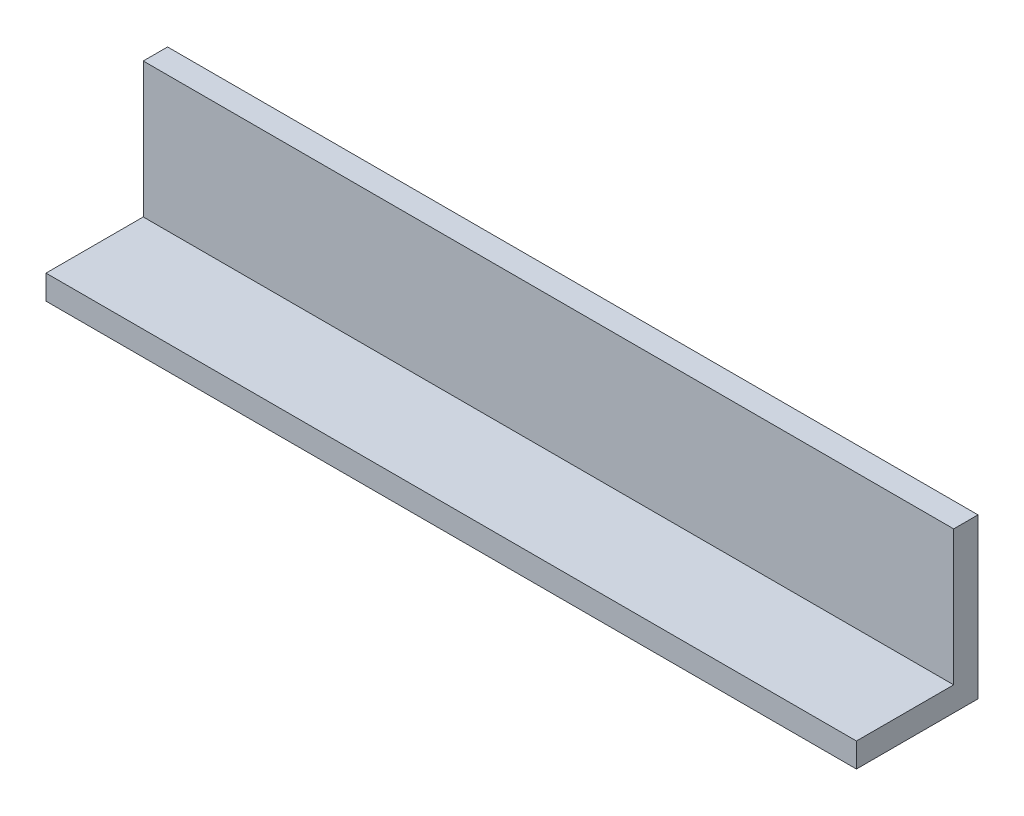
from build123d import *

# Parameters (mm, degrees)
ESBO_O2_W                = 600
ESBO_O2_H                = 100
RESSALTO_EXTRUS_O1_DEPTH = 18
ESBO_O3_W                = 600
ESBO_O3_H                = 90
RESSALTO_EXTRUS_O2_DEPTH = 18


with BuildPart() as part:
    # Esbo_o2 → Ressalto-extrus_o1 (new body)
    with BuildSketch(Plane.XY):
        with Locations((0.049719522, -50)):
            Rectangle(ESBO_O2_W, ESBO_O2_H)
    extrude(amount=RESSALTO_EXTRUS_O1_DEPTH)

    # Esbo_o3 → Ressalto-extrus_o2 (add)
    with BuildSketch(Plane(origin=(0, -100, 0), x_dir=(1, 0, 0), z_dir=(0, 1, 0))):
        with Locations((0.049719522, -45)):
            Rectangle(ESBO_O3_W, ESBO_O3_H)
    extrude(amount=-RESSALTO_EXTRUS_O2_DEPTH)


solid = part.part
